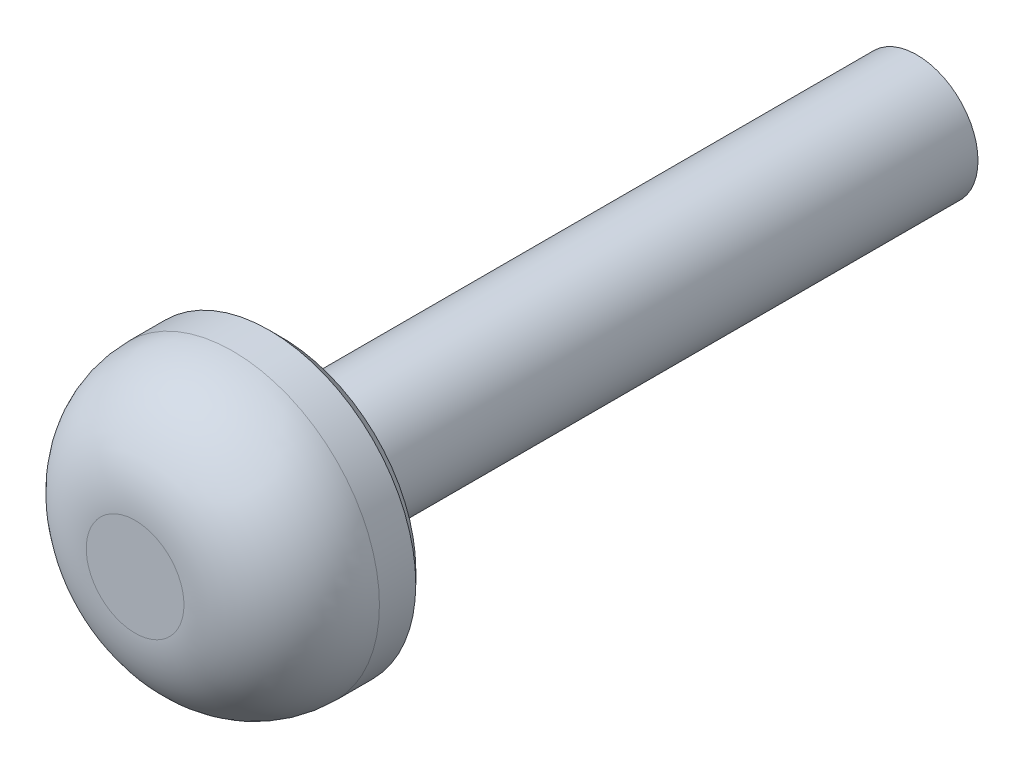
from build123d import *

# Parameters (mm, degrees)
SKETCH1_R           = 1.25
BOSS_EXTRUDE1_DEPTH = 16
SKETCH2_R           = 3
BOSS_EXTRUDE2_DEPTH = 3
FILLET1_R           = 2
CHAMFER1_SIZE       = 0.256


with BuildPart() as part:
    # Sketch1 → Boss-Extrude1 (new body)
    with BuildSketch(Plane.XY):
        Circle(SKETCH1_R)
    extrude(amount=BOSS_EXTRUDE1_DEPTH)

    # Sketch2 → Boss-Extrude2 (add)
    with BuildSketch(Plane.XY.offset(16)):
        Circle(SKETCH2_R)
    extrude(amount=-BOSS_EXTRUDE2_DEPTH)

    # Fillet1
    fillet1_edges = [part.edges().sort_by_distance(p)[0] for p in [
        (-3, 0, 16),
    ]]
    fillet(fillet1_edges, radius=FILLET1_R)

    # Chamfer1
    chamfer1_edges = [part.edges().sort_by_distance(p)[0] for p in [
        (-3, 0, 13),
    ]]
    chamfer(chamfer1_edges, length=CHAMFER1_SIZE)


solid = part.part
